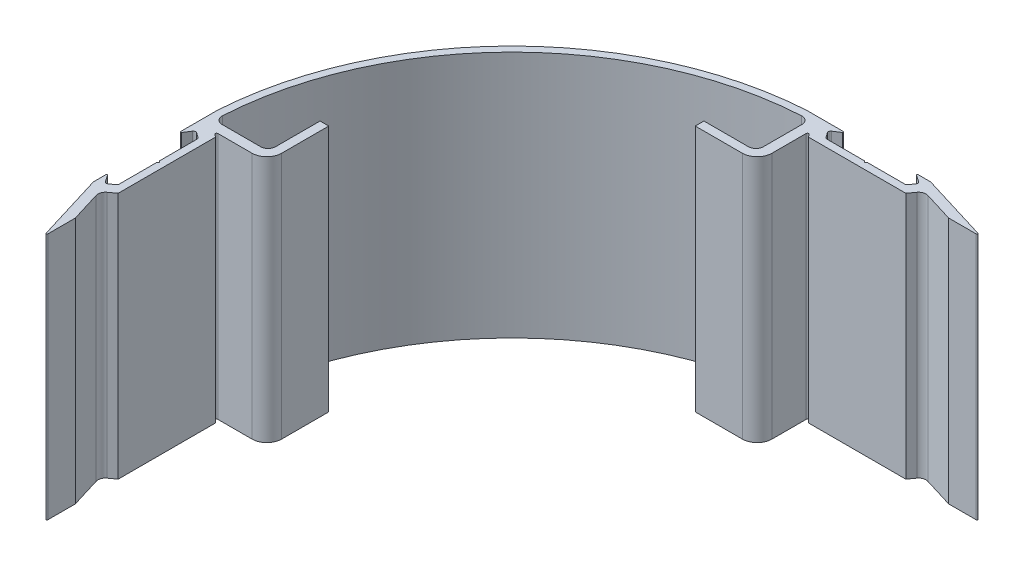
from build123d import *

# Parameters (mm, degrees)
EXTRUDE1_DEPTH = 50


with BuildPart() as part:
    # Sketch1 → Extrude1 (new, symmetric)
    with BuildSketch(Plane(origin=(0, 0, 0), x_dir=(1, 0, 0), z_dir=(0, 1, 0))):
        with BuildLine():
            Line((-121.027466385, 3.970436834), (-105.48, 3.970436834))
            ThreePointArc((-105.48, 3.970436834), (-103.358679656, 4.849116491), (-102.48, 6.970436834))
            Line((-102.48, 6.970436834), (-102.48, 24.970436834))
            Line((-102.48, 24.970436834), (-98.98, 24.970436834))
            Line((-98.98, 24.970436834), (-98.98, 5.970436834))
            ThreePointArc((-98.98, 5.970436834), (-100.737359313, 1.727796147), (-104.98, -0.029563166))
            Line((-104.98, -0.029563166), (-118.743663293, -0.029563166))
            ThreePointArc((-118.743663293, -0.029563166), (-119.234728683, -0.386343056), (-119.047158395, -0.963625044))
            Line((-119.047158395, -0.963625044), (-117.98, -1.738961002))
            Line((-117.98, -1.738961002), (-117.98, -41.065006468))
            Line((-117.98, -41.065006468), (-120.579307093, -42.953513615))
            ThreePointArc((-120.579307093, -42.953513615), (-121.660922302, -44.428650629), (-121.684865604, -46.257679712))
            Line((-121.684865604, -46.257679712), (-117.98, -58.375749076))
            Line((-117.98, -58.375749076), (-117.98, -69.5))
            ThreePointArc((-117.98, -69.5), (-118.235657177, -69.796704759), (-118.566891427, -69.587711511))
            Line((-118.566891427, -69.587711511), (-126.98, -42.069673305))
            Line((-126.98, -42.069673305), (-126.98, -37.049640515))
            ThreePointArc((-126.98, -37.049640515), (-126.765204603, -36.761994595), (-126.42839883, -36.886248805))
            Line((-126.42839883, -36.886248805), (-124.702690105, -39.543607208))
            ThreePointArc((-124.702690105, -39.543607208), (-124.046255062, -39.98222308), (-123.276234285, -39.807985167))
            Line((-123.276234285, -39.807985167), (-121.392214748, -38.43916485))
            ThreePointArc((-121.392214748, -38.43916485), (-121.088993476, -38.084138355), (-120.98, -37.630147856))
            Line((-120.98, -37.630147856), (-120.98, -22.439673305))
            Line((-120.98, -22.439673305), (-120.48, -21.939673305))
            Line((-120.48, -21.939673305), (-120.98, -21.439673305))
            Line((-120.98, -21.439673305), (-120.98, -6.249198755))
            ThreePointArc((-120.98, -6.249198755), (-121.088993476, -5.795208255), (-121.392214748, -5.44018176))
            Line((-121.392214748, -5.44018176), (-123.276234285, -4.071361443))
            ThreePointArc((-123.276234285, -4.071361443), (-124.046255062, -3.89712353), (-124.702690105, -4.335739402))
            Line((-124.702690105, -4.335739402), (-126.42839883, -6.993097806))
            ThreePointArc((-126.42839883, -6.993097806), (-126.765204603, -7.117352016), (-126.98, -6.829706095))
            Line((-126.98, -6.829706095), (-126.98, 7.940436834))
            ThreePointArc((-126.98, 7.940436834), (-89.963800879, 89.963800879), (-7.940436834, 126.98))
            Line((-7.940436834, 126.98), (6.829706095, 126.98))
            ThreePointArc((6.829706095, 126.98), (7.117352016, 126.765204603), (6.993097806, 126.42839883))
            Line((6.993097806, 126.42839883), (4.335739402, 124.702690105))
            ThreePointArc((4.335739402, 124.702690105), (3.89712353, 124.046255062), (4.071361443, 123.276234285))
            Line((4.071361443, 123.276234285), (5.44018176, 121.392214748))
            ThreePointArc((5.44018176, 121.392214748), (5.795208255, 121.088993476), (6.249198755, 120.98))
            Line((6.249198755, 120.98), (21.439673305, 120.98))
            Line((21.439673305, 120.98), (21.939673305, 120.48))
            Line((21.939673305, 120.48), (22.439673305, 120.98))
            Line((22.439673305, 120.98), (37.630147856, 120.98))
            ThreePointArc((37.630147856, 120.98), (38.084138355, 121.088993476), (38.43916485, 121.392214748))
            Line((38.43916485, 121.392214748), (39.807985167, 123.276234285))
            ThreePointArc((39.807985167, 123.276234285), (39.98222308, 124.046255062), (39.543607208, 124.702690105))
            Line((39.543607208, 124.702690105), (36.886248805, 126.42839883))
            ThreePointArc((36.886248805, 126.42839883), (36.761994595, 126.765204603), (37.049640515, 126.98))
            Line((37.049640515, 126.98), (42.069673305, 126.98))
            Line((42.069673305, 126.98), (69.587711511, 118.566891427))
            ThreePointArc((69.587711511, 118.566891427), (69.796704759, 118.235657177), (69.5, 117.98))
            Line((69.5, 117.98), (58.375749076, 117.98))
            Line((58.375749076, 117.98), (46.257679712, 121.684865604))
            ThreePointArc((46.257679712, 121.684865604), (44.428650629, 121.660922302), (42.953513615, 120.579307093))
            Line((42.953513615, 120.579307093), (41.065006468, 117.98))
            Line((41.065006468, 117.98), (21.939673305, 117.98))
            Line((21.939673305, 117.98), (1.738961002, 117.98))
            Line((1.738961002, 117.98), (0.963625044, 119.047158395))
            ThreePointArc((0.963625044, 119.047158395), (0.386343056, 119.234728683), (0.029563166, 118.743663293))
            Line((0.029563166, 118.743663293), (0.029563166, 104.98))
            ThreePointArc((0.029563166, 104.98), (-1.727796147, 100.737359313), (-5.970436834, 98.98))
            Line((-5.970436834, 98.98), (-24.970436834, 98.98))
            Line((-24.970436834, 98.98), (-24.970436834, 102.48))
            Line((-24.970436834, 102.48), (-6.970436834, 102.48))
            ThreePointArc((-6.970436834, 102.48), (-4.849116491, 103.358679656), (-3.970436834, 105.48))
            Line((-3.970436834, 105.48), (-3.970436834, 121.027466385))
            ThreePointArc((-3.970436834, 121.027466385), (-4.911005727, 123.208920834), (-7.14293251, 124.022503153))
            ThreePointArc((-7.14293251, 124.022503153), (-87.842480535, 87.842480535), (-124.022503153, 7.14293251))
            ThreePointArc((-124.022503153, 7.14293251), (-123.208920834, 4.911005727), (-121.027466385, 3.970436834))
        make_face()
    extrude(amount=EXTRUDE1_DEPTH, both=True)


solid = part.part
